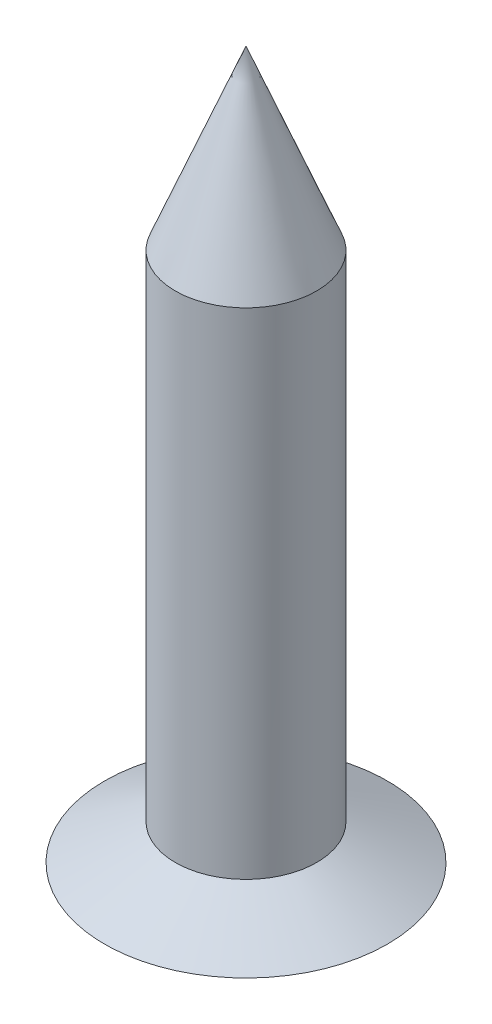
from build123d import *


with BuildPart() as part:
    # Croquis1 → Revoluci_n1 (revolve)
    with BuildSketch(Plane.XY, mode=Mode.PRIVATE) as revoluci_n1_sk:
        Polygon((0, 0), (4, 0), (2, 1), (2, 15), (0, 20), align=None)
    revolve(revoluci_n1_sk.sketch.rotate(Axis((0, 20, 0), (0, -1, 0)), 180), axis=Axis((0, 20, 0), (0, -1, 0)))


solid = part.part
